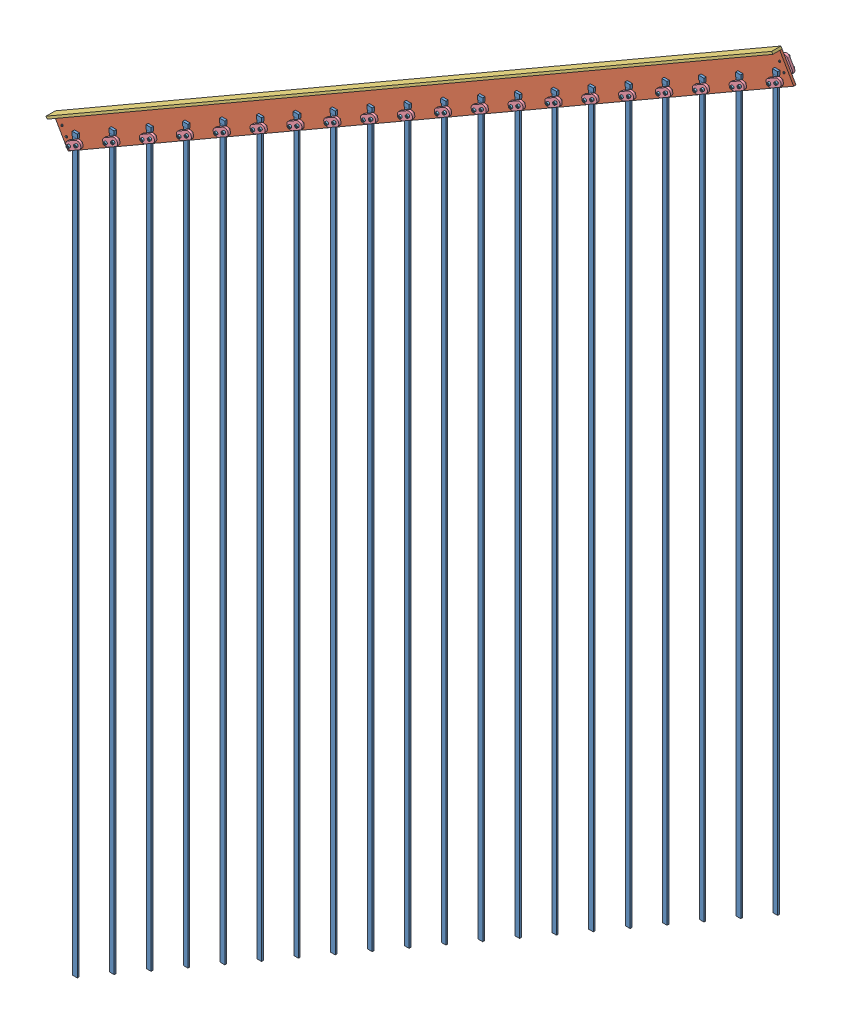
SolidWorks assembly fs-ua-angled-mount-assembly-with-led-strips.SLDASM, configuration Default (file format 9000). Lengths in mm.
Overall size (2026.51 3158.55 44.16).
90 component instances, 5 part files, 0 mates.
Components (placement in the parent):
- fs-led-strip-1: fs-led-strip.SLDPRT [Default] at origin size (14.29 2000 6.35)
- fs-ua-angled-mount-assembly-with-screws-1: fs-ua-angled-mount-assembly-with-screws.SLDASM [Default] at (-24.8458 -53.5614 -9.8077) x (0.866025 0.5 0) z (0 0 1) size (2292.35 82.55 44.16)
  - fs-ua-angled-mount-assembly-1: fs-ua-angled-mount-assembly.SLDASM [Default] at origin size (2292.35 82.55 38)
    - fs-ua-angled-mount-vertical-component-1: fs-ua-angled-mount-vertical-component.SLDPRT [Default] at origin size (2292.35 76.2 6.35)
    - fs-ua-angled-mount-horizontal-component-1: fs-ua-angled-mount-horizontal-component.SLDPRT [Default] at (1146.175 76.2 12.7) size (2292.35 6.35 25.4)
    - fs-clamp-1: fs-clamp.SLDPRT [Default] at (27.94 15.24 12.8007) size (44.45 20.32 6.35)
    - fs-clamp-2: fs-clamp.SLDPRT [Default] at (144.3789 15.24 12.8007) size (44.45 20.32 6.35)
    - fs-clamp-3: fs-clamp.SLDPRT [Default] at (260.8179 15.24 12.8007) size (44.45 20.32 6.35)
    - fs-clamp-4: fs-clamp.SLDPRT [Default] at (377.2568 15.24 12.8007) size (44.45 20.32 6.35)
    - fs-clamp-5: fs-clamp.SLDPRT [Default] at (493.6957 15.24 12.8007) size (44.45 20.32 6.35)
    - fs-clamp-6: fs-clamp.SLDPRT [Default] at (610.1347 15.24 12.8007) size (44.45 20.32 6.35)
    - fs-clamp-7: fs-clamp.SLDPRT [Default] at (726.5736 15.24 12.8007) size (44.45 20.32 6.35)
    - fs-clamp-8: fs-clamp.SLDPRT [Default] at (843.0125 15.24 12.8007) size (44.45 20.32 6.35)
    - fs-clamp-9: fs-clamp.SLDPRT [Default] at (959.4515 15.24 12.8007) size (44.45 20.32 6.35)
    - fs-clamp-10: fs-clamp.SLDPRT [Default] at (1075.8904 15.24 12.8007) size (44.45 20.32 6.35)
    - fs-clamp-11: fs-clamp.SLDPRT [Default] at (1192.3293 15.24 12.8007) size (44.45 20.32 6.35)
    - fs-clamp-12: fs-clamp.SLDPRT [Default] at (1308.7683 15.24 12.8007) size (44.45 20.32 6.35)
    - fs-clamp-13: fs-clamp.SLDPRT [Default] at (1425.2072 15.24 12.8007) size (44.45 20.32 6.35)
    - fs-clamp-14: fs-clamp.SLDPRT [Default] at (1541.6461 15.24 12.8007) size (44.45 20.32 6.35)
    - fs-clamp-15: fs-clamp.SLDPRT [Default] at (1658.0851 15.24 12.8007) size (44.45 20.32 6.35)
    - fs-clamp-16: fs-clamp.SLDPRT [Default] at (1774.524 15.24 12.8007) size (44.45 20.32 6.35)
    - fs-clamp-17: fs-clamp.SLDPRT [Default] at (1890.9629 15.24 12.8007) size (44.45 20.32 6.35)
    - fs-clamp-18: fs-clamp.SLDPRT [Default] at (2007.4019 15.24 12.8007) size (44.45 20.32 6.35)
    - fs-clamp-19: fs-clamp.SLDPRT [Default] at (12.7 53.975 -12.5735) x (0 -1 0) z (0 0 1) size (44.45 20.32 6.35)
    - fs-clamp-20: fs-clamp.SLDPRT [Default] at (2279.65 29.845 -12.5985) x (0 1 0) z (0 0 1) size (44.45 20.32 6.35)
    - fs-clamp-21: fs-clamp.SLDPRT [Default] at (2123.8408 15.24 12.8007) size (44.45 20.32 6.35)
    - fs-clamp-22: fs-clamp.SLDPRT [Default] at (2240.2797 15.24 12.8007) size (44.45 20.32 6.35)
  - socket head cap screw_ai-1: socket head cap screw_ai.sldprt [HX-SHCS 0.19-32x0.875x0.875-N] at (27.94 15.24 25.0524) x (0 0 -1) z (-0.570283 0.821448 0) size (27.05 7.94 7.94)
  - socket head cap screw_ai-3: socket head cap screw_ai.sldprt [HX-SHCS 0.19-32x0.875x0.875-N] at (52.07 15.24 25.3347) x (0 0 -1) z (0.61191 -0.790927 0) size (27.05 7.94 7.94)
  - socket head cap screw_ai-4: socket head cap screw_ai.sldprt [HX-SHCS 0.19-32x0.875x0.875-N] at (12.7 29.845 -18.7638) x (0 0 1) z (-0.601781 -0.798661 0) size (27.05 7.94 7.94)
  - socket head cap screw_ai-5: socket head cap screw_ai.sldprt [HX-SHCS 0.19-32x0.875x0.875-N] at (12.7 53.975 -18.6513) x (0 0 1) z (0.101721 0.994813 0) size (27.05 7.94 7.94)
  - socket head cap screw_ai-6: socket head cap screw_ai.sldprt [HX-SHCS 0.19-32x0.875x0.875-N] at (2279.65 29.845 -18.7537) x (0 0 1) z (-0.220834 -0.975311 0) size (27.05 7.94 7.94)
  - socket head cap screw_ai-7: socket head cap screw_ai.sldprt [HX-SHCS 0.19-32x0.875x0.875-N] at (2279.65 53.975 -18.662) x (0 0 1) z (-0.85708 -0.515183 0) size (27.05 7.94 7.94)
  - socket head cap screw_ai-8: socket head cap screw_ai.sldprt [HX-SHCS 0.19-32x0.875x0.875-N] at (144.3789 15.24 25.0524) x (0 0 -1) z (-0.570283 0.821448 0) size (27.05 7.94 7.94)
  - socket head cap screw_ai-9: socket head cap screw_ai.sldprt [HX-SHCS 0.19-32x0.875x0.875-N] at (260.8179 15.24 25.0524) x (0 0 -1) z (-0.570283 0.821448 0) size (27.05 7.94 7.94)
  - socket head cap screw_ai-10: socket head cap screw_ai.sldprt [HX-SHCS 0.19-32x0.875x0.875-N] at (377.2568 15.24 25.0524) x (0 0 -1) z (-0.570283 0.821448 0) size (27.05 7.94 7.94)
  - socket head cap screw_ai-11: socket head cap screw_ai.sldprt [HX-SHCS 0.19-32x0.875x0.875-N] at (493.6957 15.24 25.0524) x (0 0 -1) z (-0.570283 0.821448 0) size (27.05 7.94 7.94)
  - socket head cap screw_ai-12: socket head cap screw_ai.sldprt [HX-SHCS 0.19-32x0.875x0.875-N] at (610.1347 15.24 25.0524) x (0 0 -1) z (-0.570283 0.821448 0) size (27.05 7.94 7.94)
  - socket head cap screw_ai-13: socket head cap screw_ai.sldprt [HX-SHCS 0.19-32x0.875x0.875-N] at (726.5736 15.24 25.0524) x (0 0 -1) z (-0.570283 0.821448 0) size (27.05 7.94 7.94)
  - socket head cap screw_ai-14: socket head cap screw_ai.sldprt [HX-SHCS 0.19-32x0.875x0.875-N] at (843.0125 15.24 25.0524) x (0 0 -1) z (-0.570283 0.821448 0) size (27.05 7.94 7.94)
  - socket head cap screw_ai-15: socket head cap screw_ai.sldprt [HX-SHCS 0.19-32x0.875x0.875-N] at (959.4515 15.24 25.0524) x (0 0 -1) z (-0.570283 0.821448 0) size (27.05 7.94 7.94)
  - socket head cap screw_ai-16: socket head cap screw_ai.sldprt [HX-SHCS 0.19-32x0.875x0.875-N] at (1075.8904 15.24 25.0524) x (0 0 -1) z (-0.570283 0.821448 0) size (27.05 7.94 7.94)
  - socket head cap screw_ai-17: socket head cap screw_ai.sldprt [HX-SHCS 0.19-32x0.875x0.875-N] at (1192.3293 15.24 25.0524) x (0 0 -1) z (-0.570283 0.821448 0) size (27.05 7.94 7.94)
  - socket head cap screw_ai-18: socket head cap screw_ai.sldprt [HX-SHCS 0.19-32x0.875x0.875-N] at (1308.7683 15.24 25.0524) x (0 0 -1) z (-0.570283 0.821448 0) size (27.05 7.94 7.94)
  - socket head cap screw_ai-19: socket head cap screw_ai.sldprt [HX-SHCS 0.19-32x0.875x0.875-N] at (1425.2072 15.24 25.0524) x (0 0 -1) z (-0.570283 0.821448 0) size (27.05 7.94 7.94)
  - socket head cap screw_ai-20: socket head cap screw_ai.sldprt [HX-SHCS 0.19-32x0.875x0.875-N] at (1541.6461 15.24 25.0524) x (0 0 -1) z (-0.570283 0.821448 0) size (27.05 7.94 7.94)
  - socket head cap screw_ai-21: socket head cap screw_ai.sldprt [HX-SHCS 0.19-32x0.875x0.875-N] at (1658.0851 15.24 25.0524) x (0 0 -1) z (-0.570283 0.821448 0) size (27.05 7.94 7.94)
  - socket head cap screw_ai-22: socket head cap screw_ai.sldprt [HX-SHCS 0.19-32x0.875x0.875-N] at (1774.524 15.24 25.0524) x (0 0 -1) z (-0.570283 0.821448 0) size (27.05 7.94 7.94)
  - socket head cap screw_ai-23: socket head cap screw_ai.sldprt [HX-SHCS 0.19-32x0.875x0.875-N] at (1890.9629 15.24 25.0524) x (0 0 -1) z (-0.570283 0.821448 0) size (27.05 7.94 7.94)
  - socket head cap screw_ai-24: socket head cap screw_ai.sldprt [HX-SHCS 0.19-32x0.875x0.875-N] at (2007.4019 15.24 25.0524) x (0 0 -1) z (-0.570283 0.821448 0) size (27.05 7.94 7.94)
  - socket head cap screw_ai-25: socket head cap screw_ai.sldprt [HX-SHCS 0.19-32x0.875x0.875-N] at (168.4835 15.24 25.3347) x (0 0 -1) z (0.61191 -0.790927 0) size (27.05 7.94 7.94)
  - socket head cap screw_ai-26: socket head cap screw_ai.sldprt [HX-SHCS 0.19-32x0.875x0.875-N] at (284.8971 15.24 25.3347) x (0 0 -1) z (0.61191 -0.790927 0) size (27.05 7.94 7.94)
  - socket head cap screw_ai-27: socket head cap screw_ai.sldprt [HX-SHCS 0.19-32x0.875x0.875-N] at (401.3106 15.24 25.3347) x (0 0 -1) z (0.61191 -0.790927 0) size (27.05 7.94 7.94)
  - socket head cap screw_ai-28: socket head cap screw_ai.sldprt [HX-SHCS 0.19-32x0.875x0.875-N] at (517.7241 15.24 25.3347) x (0 0 -1) z (0.61191 -0.790927 0) size (27.05 7.94 7.94)
  - socket head cap screw_ai-29: socket head cap screw_ai.sldprt [HX-SHCS 0.19-32x0.875x0.875-N] at (634.1377 15.24 25.3347) x (0 0 -1) z (0.61191 -0.790927 0) size (27.05 7.94 7.94)
  - socket head cap screw_ai-30: socket head cap screw_ai.sldprt [HX-SHCS 0.19-32x0.875x0.875-N] at (750.5512 15.24 25.3347) x (0 0 -1) z (0.61191 -0.790927 0) size (27.05 7.94 7.94)
  - socket head cap screw_ai-31: socket head cap screw_ai.sldprt [HX-SHCS 0.19-32x0.875x0.875-N] at (866.9647 15.24 25.3347) x (0 0 -1) z (0.61191 -0.790927 0) size (27.05 7.94 7.94)
  - socket head cap screw_ai-32: socket head cap screw_ai.sldprt [HX-SHCS 0.19-32x0.875x0.875-N] at (983.3783 15.24 25.3347) x (0 0 -1) z (0.61191 -0.790927 0) size (27.05 7.94 7.94)
  - socket head cap screw_ai-33: socket head cap screw_ai.sldprt [HX-SHCS 0.19-32x0.875x0.875-N] at (1099.7918 15.24 25.3347) x (0 0 -1) z (0.61191 -0.790927 0) size (27.05 7.94 7.94)
  - socket head cap screw_ai-34: socket head cap screw_ai.sldprt [HX-SHCS 0.19-32x0.875x0.875-N] at (1216.2053 15.24 25.3347) x (0 0 -1) z (0.61191 -0.790927 0) size (27.05 7.94 7.94)
  - socket head cap screw_ai-35: socket head cap screw_ai.sldprt [HX-SHCS 0.19-32x0.875x0.875-N] at (1332.6189 15.24 25.3347) x (0 0 -1) z (0.61191 -0.790927 0) size (27.05 7.94 7.94)
  - socket head cap screw_ai-36: socket head cap screw_ai.sldprt [HX-SHCS 0.19-32x0.875x0.875-N] at (1449.0324 15.24 25.3347) x (0 0 -1) z (0.61191 -0.790927 0) size (27.05 7.94 7.94)
  - socket head cap screw_ai-37: socket head cap screw_ai.sldprt [HX-SHCS 0.19-32x0.875x0.875-N] at (1565.4459 15.24 25.3347) x (0 0 -1) z (0.61191 -0.790927 0) size (27.05 7.94 7.94)
  - socket head cap screw_ai-38: socket head cap screw_ai.sldprt [HX-SHCS 0.19-32x0.875x0.875-N] at (1681.8595 15.24 25.3347) x (0 0 -1) z (0.61191 -0.790927 0) size (27.05 7.94 7.94)
  - socket head cap screw_ai-39: socket head cap screw_ai.sldprt [HX-SHCS 0.19-32x0.875x0.875-N] at (1798.273 15.24 25.3347) x (0 0 -1) z (0.61191 -0.790927 0) size (27.05 7.94 7.94)
  - socket head cap screw_ai-40: socket head cap screw_ai.sldprt [HX-SHCS 0.19-32x0.875x0.875-N] at (1914.6865 15.24 25.3347) x (0 0 -1) z (0.61191 -0.790927 0) size (27.05 7.94 7.94)
  - socket head cap screw_ai-41: socket head cap screw_ai.sldprt [HX-SHCS 0.19-32x0.875x0.875-N] at (2031.1001 15.24 25.3347) x (0 0 -1) z (0.61191 -0.790927 0) size (27.05 7.94 7.94)
  - socket head cap screw_ai-42: socket head cap screw_ai.sldprt [HX-SHCS 0.19-32x0.875x0.875-N] at (2123.8408 15.24 25.0524) x (0 0 -1) z (-0.570283 0.821448 0) size (27.05 7.94 7.94)
  - socket head cap screw_ai-43: socket head cap screw_ai.sldprt [HX-SHCS 0.19-32x0.875x0.875-N] at (2240.2797 15.24 25.0524) x (0 0 -1) z (-0.570283 0.821448 0) size (27.05 7.94 7.94)
  - socket head cap screw_ai-44: socket head cap screw_ai.sldprt [HX-SHCS 0.19-32x0.875x0.875-N] at (2147.5136 15.24 25.3347) x (0 0 -1) z (0.61191 -0.790927 0) size (27.05 7.94 7.94)
  - socket head cap screw_ai-45: socket head cap screw_ai.sldprt [HX-SHCS 0.19-32x0.875x0.875-N] at (2263.9271 15.24 25.3347) x (0 0 -1) z (0.61191 -0.790927 0) size (27.05 7.94 7.94)
- fs-led-strip-2: fs-led-strip.SLDPRT [Default] at (100.8391 58.2195 0) size (14.29 2000 6.35)
- fs-led-strip-3: fs-led-strip.SLDPRT [Default] at (201.6781 116.4389 0) size (14.29 2000 6.35)
- fs-led-strip-4: fs-led-strip.SLDPRT [Default] at (302.5172 174.6584 0) size (14.29 2000 6.35)
- fs-led-strip-5: fs-led-strip.SLDPRT [Default] at (403.3563 232.8779 0) size (14.29 2000 6.35)
- fs-led-strip-6: fs-led-strip.SLDPRT [Default] at (504.1954 291.0973 0) size (14.29 2000 6.35)
- fs-led-strip-7: fs-led-strip.SLDPRT [Default] at (605.0344 349.3168 0) size (14.29 2000 6.35)
- fs-led-strip-8: fs-led-strip.SLDPRT [Default] at (705.8735 407.5363 0) size (14.29 2000 6.35)
- fs-led-strip-9: fs-led-strip.SLDPRT [Default] at (806.7126 465.7557 0) size (14.29 2000 6.35)
- fs-led-strip-10: fs-led-strip.SLDPRT [Default] at (907.5517 523.9752 0) size (14.29 2000 6.35)
- fs-led-strip-11: fs-led-strip.SLDPRT [Default] at (1008.3907 582.1947 0) size (14.29 2000 6.35)
- fs-led-strip-12: fs-led-strip.SLDPRT [Default] at (1109.2298 640.4141 0) size (14.29 2000 6.35)
- fs-led-strip-13: fs-led-strip.SLDPRT [Default] at (1210.0689 698.6336 0) size (14.29 2000 6.35)
- fs-led-strip-14: fs-led-strip.SLDPRT [Default] at (1310.908 756.8531 0) size (14.29 2000 6.35)
- fs-led-strip-15: fs-led-strip.SLDPRT [Default] at (1411.747 815.0725 0) size (14.29 2000 6.35)
- fs-led-strip-16: fs-led-strip.SLDPRT [Default] at (1512.5861 873.292 0) size (14.29 2000 6.35)
- fs-led-strip-17: fs-led-strip.SLDPRT [Default] at (1613.4252 931.5115 0) size (14.29 2000 6.35)
- fs-led-strip-18: fs-led-strip.SLDPRT [Default] at (1714.2643 989.7309 0) size (14.29 2000 6.35)
- fs-led-strip-19: fs-led-strip.SLDPRT [Default] at (1815.1033 1047.9504 0) size (14.29 2000 6.35)
- fs-led-strip-20: fs-led-strip.SLDPRT [Default] at (1915.9424 1106.1699 0) size (14.29 2000 6.35)
